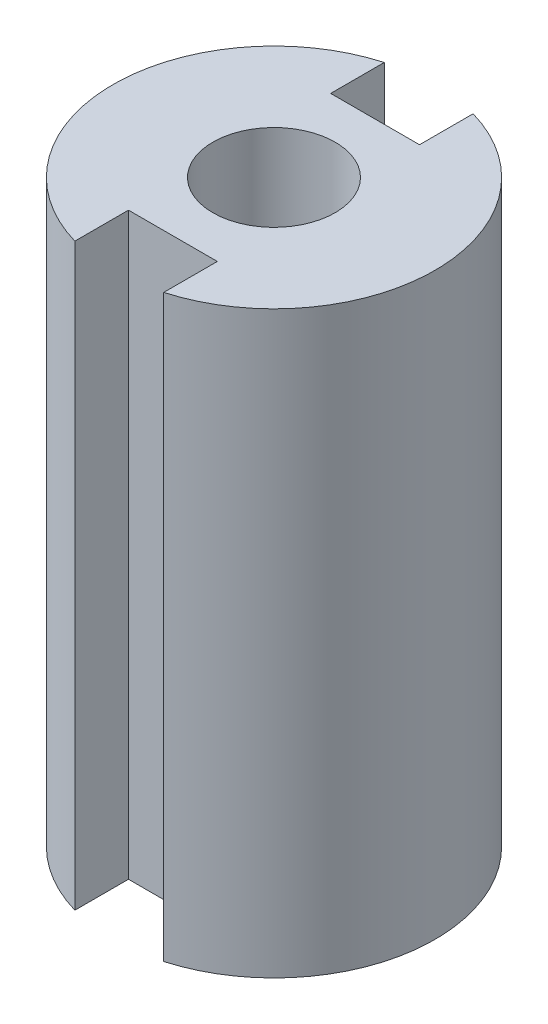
from build123d import *

# Parameters (mm, degrees)
SKETCH1_R          = 6.35
EXTRUDE1_DEPTH     = 22.86
SKETCH2_R          = 2.413
CUT_EXTRUDE1_DEPTH = 21.59
SKETCH3_R          = 1.7272
CUT_EXTRUDE2_DEPTH = 2.54
SKETCH4_W          = 3.5052
SKETCH4_H          = 2.725252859
CUT_EXTRUDE3_DEPTH = 25.560631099


with BuildPart() as part:
    # Sketch1 → Extrude1 (new body)
    with BuildSketch(Plane(origin=(0, 0, 0), x_dir=(1, 0, 0), z_dir=(0, 1, 0))):
        with Locations(Location((0, 0, 0), (0, 0, 270))):
            Circle(SKETCH1_R)
    extrude(amount=EXTRUDE1_DEPTH)

    # Sketch2 → Cut-Extrude1 (cut)
    with BuildSketch(Plane(origin=(0, 22.86, 0), x_dir=(-1, 0, 0), z_dir=(0, 1, 0))):
        with Locations(Location((0, 0, 0), (0, 0, 90))):
            Circle(SKETCH2_R)
    extrude(amount=-CUT_EXTRUDE1_DEPTH, mode=Mode.SUBTRACT)

    # Sketch3 → Cut-Extrude2 (cut)
    with BuildSketch(Plane.XZ):
        with Locations(Location((0, 0, 0), (0, 0, 270))):
            Circle(SKETCH3_R)
    extrude(amount=-CUT_EXTRUDE2_DEPTH, mode=Mode.SUBTRACT)

    # Sketch4 → Cut-Extrude3 (cut, through all)
    with BuildSketch(Plane(origin=(0, 22.86, 0), x_dir=(-1, 0, 0), z_dir=(0, 1, 0))):
        with Locations((0, 5.35042643)):
            Rectangle(SKETCH4_W, SKETCH4_H)
        with Locations((0, -5.35042643)):
            Rectangle(SKETCH4_W, SKETCH4_H)
    extrude(amount=-CUT_EXTRUDE3_DEPTH, mode=Mode.SUBTRACT)


solid = part.part
